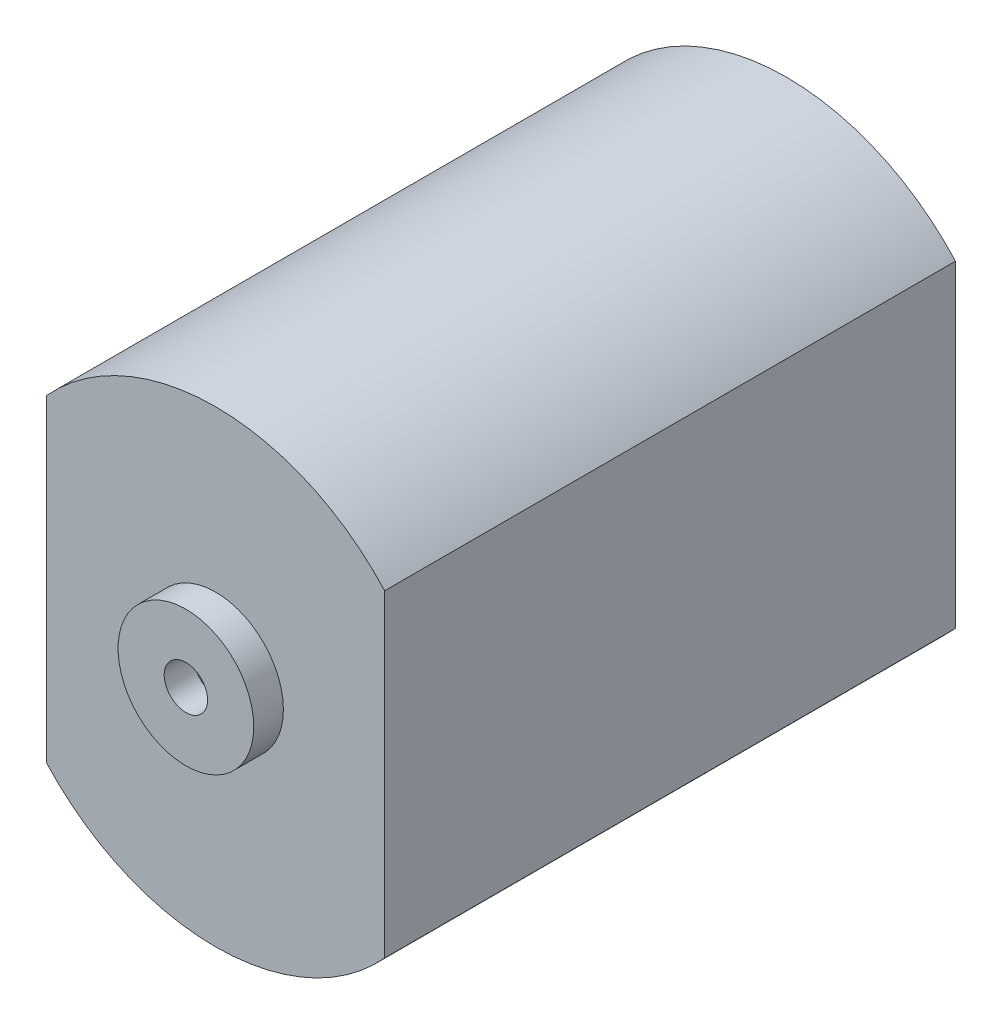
from build123d import *

# Parameters (mm, degrees)
BOSS_EXTRUDE1_DEPTH = 25
SKETCH3_R           = 2.97
BOSS_EXTRUDE2_DEPTH = 1.3
SKETCH4_R           = 0.95
CUT_EXTRUDE1_DEPTH  = 1.3


with BuildPart() as part:
    # Sketch2 → Boss-Extrude1 (new body)
    with BuildSketch(Plane.XY):
        with BuildLine():
            Line((0, 0), (0, 13.93))
            ThreePointArc((0, 13.93), (-7.405, 17.209436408), (-14.81, 13.93))
            Line((-14.81, 13.93), (-14.81, 0))
            ThreePointArc((-14.81, 0), (-7.405, -3.279436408), (0, 0))
        make_face()
    extrude(amount=BOSS_EXTRUDE1_DEPTH)

    # Sketch3 → Boss-Extrude2 (add)
    with BuildSketch(Plane.XY.offset(25)):
        with Locations((-7.405, 7.209436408)):
            Circle(SKETCH3_R)
    extrude(amount=BOSS_EXTRUDE2_DEPTH)

    # Sketch4 → Cut-Extrude1 (cut)
    with BuildSketch(Plane.XY.offset(26.3)):
        with Locations((-7.405, 7.209436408)):
            Circle(SKETCH4_R)
    extrude(amount=-CUT_EXTRUDE1_DEPTH, mode=Mode.SUBTRACT)


solid = part.part
